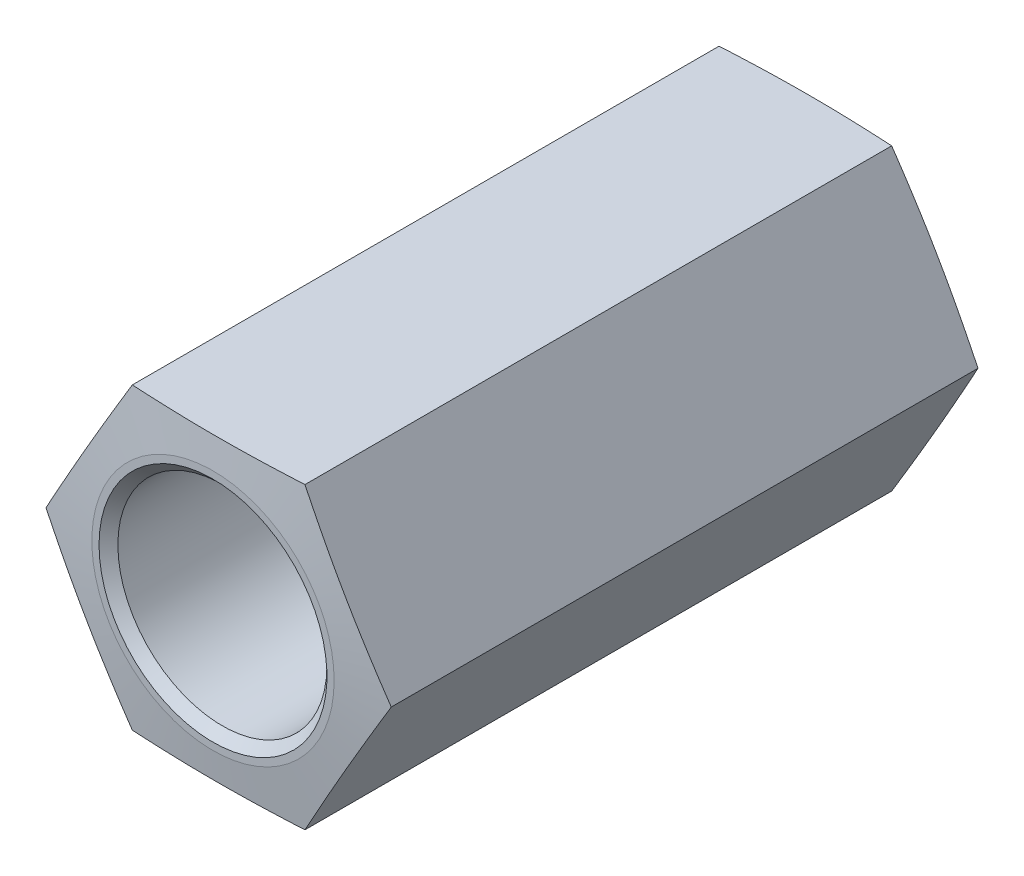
from build123d import *

# Parameters (mm, degrees)
SKETCH1_R      = 2.220000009
EXTRUDE1_DEPTH = 6.35
CHAMFER1_SIZE  = 0.2


with BuildPart() as part:
    # Sketch1 → Extrude1 (new, symmetric)
    with BuildSketch(Plane.XY):
        Polygon((-3.666174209, -6.3e-08), (-1.833087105, -3.175000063), (1.833087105, -3.174999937), (3.666174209, 6.3e-08), (1.833087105, 3.175000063), (-1.833087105, 3.174999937), align=None)
        with Locations((0, -6.3e-08)):
            Circle(SKETCH1_R, mode=Mode.SUBTRACT)
    extrude(amount=EXTRUDE1_DEPTH, both=True)

    # Chamfer1
    chamfer1_edges = [part.edges().sort_by_distance(p)[0] for p in [
        (-2.220000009, -6.3e-08, -6.35),
        (-2.220000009, -6.3e-08, 6.35),
    ]]
    chamfer(chamfer1_edges, length=CHAMFER1_SIZE)

    # Sketch2 → Cut-Revolve1 (revolve, cut)
    with BuildSketch(Plane.XZ, mode=Mode.PRIVATE) as cut_revolve1_sk:
        Polygon((-2.572739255, -6.35), (-3.666174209, -6.23), (-3.666174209, -6.35), align=None)
    cut_revolve1 = revolve(cut_revolve1_sk.sketch.rotate(Axis((0, -6.3e-08, 6.35), (0, 0, -1)), 359.999998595), axis=Axis((0, -6.3e-08, 6.35), (0, 0, -1)), mode=Mode.SUBTRACT)

    # Mirror1: Cut-Revolve1 across plane
    add(cut_revolve1.mirror(Plane.XY), mode=Mode.SUBTRACT)


solid = part.part
